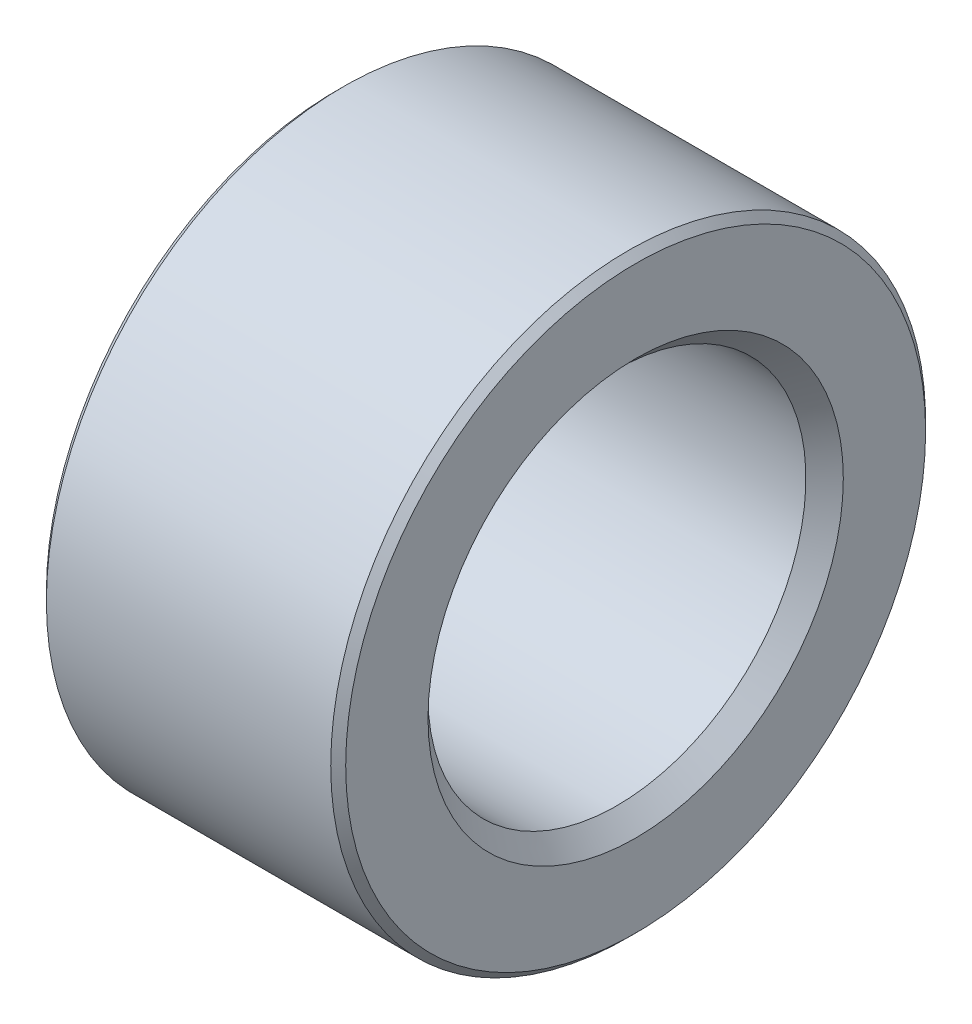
ISO-10303-21;
HEADER;
FILE_DESCRIPTION(('STEP AP214'),'2;1');
FILE_NAME('part.step','',(''),(''),'','','');
FILE_SCHEMA(('AUTOMOTIVE_DESIGN { 1 0 10303 214 1 1 1 1 }'));
ENDSEC;
DATA;
#1=APPLICATION_CONTEXT('core data for automotive mechanical design processes');
#2=APPLICATION_PROTOCOL_DEFINITION('international standard','automotive_design',2000,#1);
#3=PRODUCT_CONTEXT('',#1,'mechanical');
#4=PRODUCT('Part','Part','',(#3));
#5=PRODUCT_RELATED_PRODUCT_CATEGORY('part','',(#4));
#6=PRODUCT_DEFINITION_FORMATION('','',#4);
#7=PRODUCT_DEFINITION_CONTEXT('part definition',#1,'design');
#8=PRODUCT_DEFINITION('design','',#6,#7);
#9=PRODUCT_DEFINITION_SHAPE('','',#8);
#10=(LENGTH_UNIT() NAMED_UNIT(*) SI_UNIT(.MILLI.,.METRE.));
#11=(NAMED_UNIT(*) PLANE_ANGLE_UNIT() SI_UNIT($,.RADIAN.));
#12=(NAMED_UNIT(*) SI_UNIT($,.STERADIAN.) SOLID_ANGLE_UNIT());
#13=UNCERTAINTY_MEASURE_WITH_UNIT(LENGTH_MEASURE(1.E-05),#10,'distance_accuracy_value','');
#14=(GEOMETRIC_REPRESENTATION_CONTEXT(3) GLOBAL_UNCERTAINTY_ASSIGNED_CONTEXT((#13)) GLOBAL_UNIT_ASSIGNED_CONTEXT((#10,
#11,#12)) REPRESENTATION_CONTEXT('',''));
#15=CARTESIAN_POINT('',(0.,0.,0.));
#16=DIRECTION('',(0.,0.,1.));
#17=DIRECTION('',(1.,0.,0.));
#18=AXIS2_PLACEMENT_3D('',#15,#16,#17);
#19=CARTESIAN_POINT('',(0.,0.,0.));
#20=DIRECTION('',(1.,0.,0.));
#21=DIRECTION('',(0.,0.,-1.));
#22=AXIS2_PLACEMENT_3D('',#19,#20,#21);
#23=CONICAL_SURFACE('',#22,5.55,0.785398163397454);
#24=CARTESIAN_POINT('',(-0.499999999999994,0.,0.));
#25=DIRECTION('',(-1.,0.,0.));
#26=DIRECTION('',(0.,0.,1.));
#27=AXIS2_PLACEMENT_3D('',#24,#25,#26);
#28=CIRCLE('',#27,5.05000000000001);
#29=CARTESIAN_POINT('',(-0.499999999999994,0.,5.05000000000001));
#30=VERTEX_POINT('',#29);
#31=EDGE_CURVE('E8',#30,#30,#28,.T.);
#32=ORIENTED_EDGE('',*,*,#31,.T.);
#33=EDGE_LOOP('',(#32));
#34=FACE_BOUND('',#33,.T.);
#35=CARTESIAN_POINT('',(0.,0.,0.));
#36=DIRECTION('',(-1.,0.,0.));
#37=DIRECTION('',(0.,0.,1.));
#38=AXIS2_PLACEMENT_3D('',#35,#36,#37);
#39=CIRCLE('',#38,5.55);
#40=CARTESIAN_POINT('',(0.,0.,5.55));
#41=VERTEX_POINT('',#40);
#42=EDGE_CURVE('E40',#41,#41,#39,.T.);
#43=ORIENTED_EDGE('',*,*,#42,.F.);
#44=EDGE_LOOP('',(#43));
#45=FACE_BOUND('',#44,.T.);
#46=ADVANCED_FACE('F12',(#34,#45),#23,.F.);
#47=CARTESIAN_POINT('',(47.5,0.,0.));
#48=DIRECTION('',(-1.,0.,0.));
#49=DIRECTION('',(0.,0.,1.));
#50=AXIS2_PLACEMENT_3D('',#47,#48,#49);
#51=CYLINDRICAL_SURFACE('',#50,5.05000000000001);
#52=CARTESIAN_POINT('',(-7.49999999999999,0.,0.));
#53=DIRECTION('',(-1.,0.,0.));
#54=DIRECTION('',(0.,0.,1.));
#55=AXIS2_PLACEMENT_3D('',#52,#53,#54);
#56=CIRCLE('',#55,5.05000000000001);
#57=CARTESIAN_POINT('',(-7.49999999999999,0.,5.05000000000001));
#58=VERTEX_POINT('',#57);
#59=EDGE_CURVE('E18',#58,#58,#56,.T.);
#60=ORIENTED_EDGE('',*,*,#59,.T.);
#61=EDGE_LOOP('',(#60));
#62=FACE_BOUND('',#61,.T.);
#63=ORIENTED_EDGE('',*,*,#31,.F.);
#64=EDGE_LOOP('',(#63));
#65=FACE_BOUND('',#64,.T.);
#66=ADVANCED_FACE('F48',(#62,#65),#51,.F.);
#67=CARTESIAN_POINT('',(-7.49999999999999,0.,0.));
#68=DIRECTION('',(-1.,0.,0.));
#69=DIRECTION('',(0.,0.,1.));
#70=AXIS2_PLACEMENT_3D('',#67,#68,#69);
#71=CONICAL_SURFACE('',#70,5.05000000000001,0.785398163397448);
#72=CARTESIAN_POINT('',(-7.99999999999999,0.,0.));
#73=DIRECTION('',(-1.,0.,0.));
#74=DIRECTION('',(0.,0.,1.));
#75=AXIS2_PLACEMENT_3D('',#72,#73,#74);
#76=CIRCLE('',#75,5.55000000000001);
#77=CARTESIAN_POINT('',(-7.99999999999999,0.,5.55000000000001));
#78=VERTEX_POINT('',#77);
#79=EDGE_CURVE('E22',#78,#78,#76,.T.);
#80=ORIENTED_EDGE('',*,*,#79,.T.);
#81=EDGE_LOOP('',(#80));
#82=FACE_BOUND('',#81,.T.);
#83=ORIENTED_EDGE('',*,*,#59,.F.);
#84=EDGE_LOOP('',(#83));
#85=FACE_BOUND('',#84,.T.);
#86=ADVANCED_FACE('F53',(#82,#85),#71,.F.);
#87=CARTESIAN_POINT('',(-8.,5.55000000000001,0.));
#88=DIRECTION('',(-1.,0.,0.));
#89=DIRECTION('',(0.,0.,1.));
#90=AXIS2_PLACEMENT_3D('',#87,#88,#89);
#91=PLANE('',#90);
#92=CARTESIAN_POINT('',(-7.99999999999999,0.,0.));
#93=DIRECTION('',(-1.,0.,0.));
#94=DIRECTION('',(0.,0.,1.));
#95=AXIS2_PLACEMENT_3D('',#92,#93,#94);
#96=CIRCLE('',#95,7.75);
#97=CARTESIAN_POINT('',(-7.99999999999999,0.,7.75));
#98=VERTEX_POINT('',#97);
#99=EDGE_CURVE('E26',#98,#98,#96,.T.);
#100=ORIENTED_EDGE('',*,*,#99,.T.);
#101=EDGE_LOOP('',(#100));
#102=FACE_BOUND('',#101,.T.);
#103=ORIENTED_EDGE('',*,*,#79,.F.);
#104=EDGE_LOOP('',(#103));
#105=FACE_BOUND('',#104,.T.);
#106=ADVANCED_FACE('F57',(#102,#105),#91,.T.);
#107=CARTESIAN_POINT('',(-7.99999999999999,0.,0.));
#108=DIRECTION('',(1.,0.,0.));
#109=DIRECTION('',(0.,0.,-1.));
#110=AXIS2_PLACEMENT_3D('',#107,#108,#109);
#111=CONICAL_SURFACE('',#110,7.75,0.785398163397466);
#112=CARTESIAN_POINT('',(-7.79999999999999,0.,0.));
#113=DIRECTION('',(-1.,0.,0.));
#114=DIRECTION('',(0.,0.,1.));
#115=AXIS2_PLACEMENT_3D('',#112,#113,#114);
#116=CIRCLE('',#115,7.95000000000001);
#117=CARTESIAN_POINT('',(-7.79999999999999,0.,7.95000000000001));
#118=VERTEX_POINT('',#117);
#119=EDGE_CURVE('E31',#118,#118,#116,.T.);
#120=ORIENTED_EDGE('',*,*,#119,.T.);
#121=EDGE_LOOP('',(#120));
#122=FACE_BOUND('',#121,.T.);
#123=ORIENTED_EDGE('',*,*,#99,.F.);
#124=EDGE_LOOP('',(#123));
#125=FACE_BOUND('',#124,.T.);
#126=ADVANCED_FACE('F64',(#122,#125),#111,.T.);
#127=CARTESIAN_POINT('',(47.5,0.,0.));
#128=DIRECTION('',(-1.,0.,0.));
#129=DIRECTION('',(0.,0.,1.));
#130=AXIS2_PLACEMENT_3D('',#127,#128,#129);
#131=CYLINDRICAL_SURFACE('',#130,7.95000000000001);
#132=CARTESIAN_POINT('',(-0.199999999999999,0.,0.));
#133=DIRECTION('',(-1.,0.,0.));
#134=DIRECTION('',(0.,0.,1.));
#135=AXIS2_PLACEMENT_3D('',#132,#133,#134);
#136=CIRCLE('',#135,7.95000000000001);
#137=CARTESIAN_POINT('',(-0.199999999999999,0.,7.95000000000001));
#138=VERTEX_POINT('',#137);
#139=EDGE_CURVE('E34',#138,#138,#136,.T.);
#140=ORIENTED_EDGE('',*,*,#139,.T.);
#141=EDGE_LOOP('',(#140));
#142=FACE_BOUND('',#141,.T.);
#143=ORIENTED_EDGE('',*,*,#119,.F.);
#144=EDGE_LOOP('',(#143));
#145=FACE_BOUND('',#144,.T.);
#146=ADVANCED_FACE('F68',(#142,#145),#131,.T.);
#147=CARTESIAN_POINT('',(-0.199999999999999,0.,0.));
#148=DIRECTION('',(-1.,0.,0.));
#149=DIRECTION('',(0.,0.,1.));
#150=AXIS2_PLACEMENT_3D('',#147,#148,#149);
#151=CONICAL_SURFACE('',#150,7.95000000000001,0.785398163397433);
#152=CARTESIAN_POINT('',(0.,0.,0.));
#153=DIRECTION('',(-1.,0.,0.));
#154=DIRECTION('',(0.,0.,1.));
#155=AXIS2_PLACEMENT_3D('',#152,#153,#154);
#156=CIRCLE('',#155,7.75000000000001);
#157=CARTESIAN_POINT('',(0.,0.,7.75000000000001));
#158=VERTEX_POINT('',#157);
#159=EDGE_CURVE('E37',#158,#158,#156,.T.);
#160=ORIENTED_EDGE('',*,*,#159,.T.);
#161=EDGE_LOOP('',(#160));
#162=FACE_BOUND('',#161,.T.);
#163=ORIENTED_EDGE('',*,*,#139,.F.);
#164=EDGE_LOOP('',(#163));
#165=FACE_BOUND('',#164,.T.);
#166=ADVANCED_FACE('F72',(#162,#165),#151,.T.);
#167=CARTESIAN_POINT('',(0.,7.75000000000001,0.));
#168=DIRECTION('',(1.,0.,0.));
#169=DIRECTION('',(0.,0.,-1.));
#170=AXIS2_PLACEMENT_3D('',#167,#168,#169);
#171=PLANE('',#170);
#172=ORIENTED_EDGE('',*,*,#42,.T.);
#173=EDGE_LOOP('',(#172));
#174=FACE_BOUND('',#173,.T.);
#175=ORIENTED_EDGE('',*,*,#159,.F.);
#176=EDGE_LOOP('',(#175));
#177=FACE_BOUND('',#176,.T.);
#178=ADVANCED_FACE('F44',(#174,#177),#171,.T.);
#179=CLOSED_SHELL('',(#46,#66,#86,#106,#126,#146,#166,#178));
#180=MANIFOLD_SOLID_BREP('B1',#179);
#181=ADVANCED_BREP_SHAPE_REPRESENTATION('',(#18,#180),#14);
#182=SHAPE_DEFINITION_REPRESENTATION(#9,#181);
ENDSEC;
END-ISO-10303-21;
